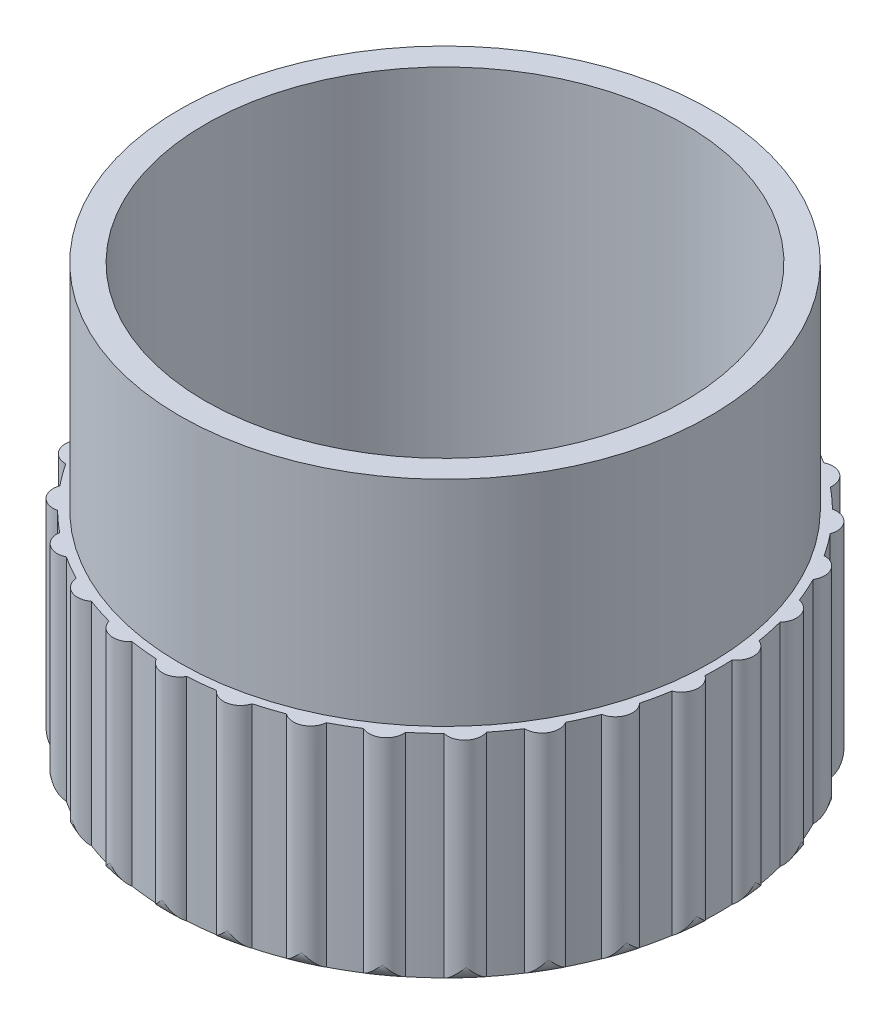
from build123d import *

# Parameters (mm, degrees)
EXTRUSION1_START             = 25
EXTRUSION1_DEPTH             = 25
R_P_TITION_CIRCULAIRE1_COUNT = 30


with BuildPart() as part:
    # Esquisse1 → R_volution1 (revolve)
    with BuildSketch(Plane.XY, mode=Mode.PRIVATE) as r_volution1_sk:
        Polygon((0, 0), (-32, 0), (-32, 25), (-31, 25), (-31, 50), (-28, 50), (-28, 3), (0, 3), align=None)
    revolve(r_volution1_sk.sketch.rotate(Axis((0, 3, 0), (0, -1, 0)), 270), axis=Axis((0, 3, 0), (0, -1, 0)))

    # Esquisse2 → Extrusion1 (add)
    with BuildSketch(Plane(origin=(0, 0, 0), x_dir=(1, 0, 0), z_dir=(0, 1, 0)).offset(EXTRUSION1_START)):
        with BuildLine():
            ThreePointArc((1.759100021, -31.951612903), (0, -33), (-1.759100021, -31.951612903))
            ThreePointArc((-1.759100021, -31.951612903), (0, -32), (1.759100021, -31.951612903))
        make_face()
    extrusion1 = extrude(amount=-EXTRUSION1_DEPTH)

    # R_p_tition circulaire1: Extrusion1 ×30 about axis
    r_p_tition_circulaire1_axis = Axis((0, 0, 0), (0, 1, 0))
    for i in range(1, R_P_TITION_CIRCULAIRE1_COUNT):
        add(extrusion1.rotate(r_p_tition_circulaire1_axis, i * 360 / R_P_TITION_CIRCULAIRE1_COUNT))

    # Esquisse3 → Enl_vement de mati_re-R_volution1 (revolve, cut)
    with BuildSketch(Plane(origin=(0, 0, 0), x_dir=(0, 0, -1), z_dir=(1, 0, 0)), mode=Mode.PRIVATE) as enl_vement_de_mati_re_r_volution1_sk:
        with BuildLine():
            Line((-33, 2), (-33, 0))
            Line((-33, 0), (-31, 0))
            ThreePointArc((-31, 0), (-32.414213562, 0.585786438), (-33, 2))
        make_face()
    revolve(enl_vement_de_mati_re_r_volution1_sk.sketch.rotate(Axis((0, 0, 0), (0, 1, 0)), 180), axis=Axis((0, 0, 0), (0, 1, 0)), mode=Mode.SUBTRACT)


solid = part.part
